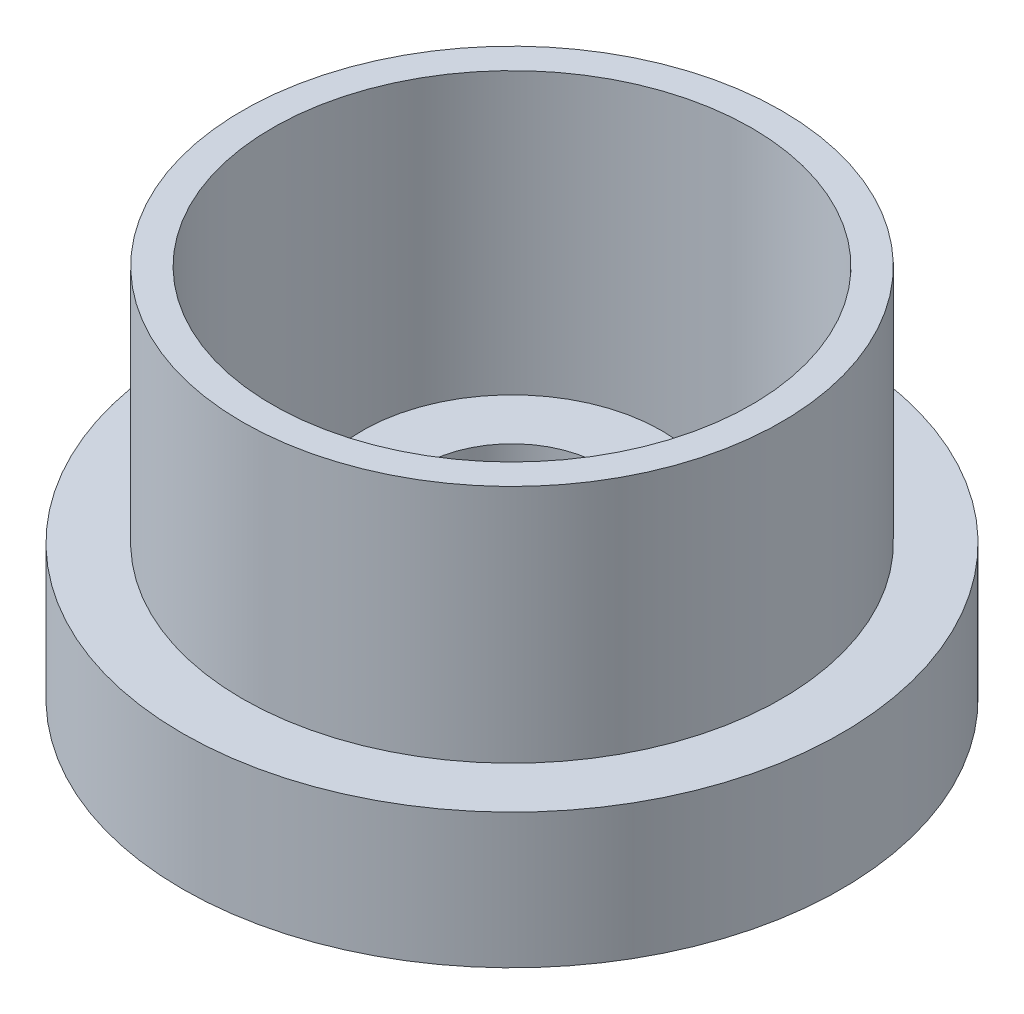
ISO-10303-21;
HEADER;
FILE_DESCRIPTION(('STEP AP214'),'2;1');
FILE_NAME('part.step','',(''),(''),'','','');
FILE_SCHEMA(('AUTOMOTIVE_DESIGN { 1 0 10303 214 1 1 1 1 }'));
ENDSEC;
DATA;
#1=APPLICATION_CONTEXT('core data for automotive mechanical design processes');
#2=APPLICATION_PROTOCOL_DEFINITION('international standard','automotive_design',2000,#1);
#3=PRODUCT_CONTEXT('',#1,'mechanical');
#4=PRODUCT('Part','Part','',(#3));
#5=PRODUCT_RELATED_PRODUCT_CATEGORY('part','',(#4));
#6=PRODUCT_DEFINITION_FORMATION('','',#4);
#7=PRODUCT_DEFINITION_CONTEXT('part definition',#1,'design');
#8=PRODUCT_DEFINITION('design','',#6,#7);
#9=PRODUCT_DEFINITION_SHAPE('','',#8);
#10=(LENGTH_UNIT() NAMED_UNIT(*) SI_UNIT(.MILLI.,.METRE.));
#11=(NAMED_UNIT(*) PLANE_ANGLE_UNIT() SI_UNIT($,.RADIAN.));
#12=(NAMED_UNIT(*) SI_UNIT($,.STERADIAN.) SOLID_ANGLE_UNIT());
#13=UNCERTAINTY_MEASURE_WITH_UNIT(LENGTH_MEASURE(1.E-05),#10,'distance_accuracy_value','');
#14=(GEOMETRIC_REPRESENTATION_CONTEXT(3) GLOBAL_UNCERTAINTY_ASSIGNED_CONTEXT((#13)) GLOBAL_UNIT_ASSIGNED_CONTEXT((#10,
#11,#12)) REPRESENTATION_CONTEXT('',''));
#15=CARTESIAN_POINT('',(0.,0.,0.));
#16=DIRECTION('',(0.,0.,1.));
#17=DIRECTION('',(1.,0.,0.));
#18=AXIS2_PLACEMENT_3D('',#15,#16,#17);
#19=CARTESIAN_POINT('',(-22.,0.,0.));
#20=DIRECTION('',(0.,1.,0.));
#21=DIRECTION('',(0.,0.,1.));
#22=AXIS2_PLACEMENT_3D('',#19,#20,#21);
#23=PLANE('',#22);
#24=CARTESIAN_POINT('',(0.,0.,0.));
#25=DIRECTION('',(0.,-1.,0.));
#26=DIRECTION('',(0.,0.,-1.));
#27=AXIS2_PLACEMENT_3D('',#24,#25,#26);
#28=CIRCLE('',#27,6.);
#29=CARTESIAN_POINT('',(0.,0.,-6.));
#30=VERTEX_POINT('',#29);
#31=EDGE_CURVE('E10',#30,#30,#28,.T.);
#32=ORIENTED_EDGE('',*,*,#31,.F.);
#33=EDGE_LOOP('',(#32));
#34=FACE_BOUND('',#33,.T.);
#35=CARTESIAN_POINT('',(0.,0.,0.));
#36=DIRECTION('',(0.,-1.,0.));
#37=DIRECTION('',(0.,0.,-1.));
#38=AXIS2_PLACEMENT_3D('',#35,#36,#37);
#39=CIRCLE('',#38,22.);
#40=CARTESIAN_POINT('',(0.,0.,-22.));
#41=VERTEX_POINT('',#40);
#42=EDGE_CURVE('E66',#41,#41,#39,.T.);
#43=ORIENTED_EDGE('',*,*,#42,.T.);
#44=EDGE_LOOP('',(#43));
#45=FACE_BOUND('',#44,.T.);
#46=ADVANCED_FACE('F32',(#34,#45),#23,.F.);
#47=CARTESIAN_POINT('',(0.,-75.1045135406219,0.));
#48=DIRECTION('',(0.,-1.,0.));
#49=DIRECTION('',(0.,0.,-1.));
#50=AXIS2_PLACEMENT_3D('',#47,#48,#49);
#51=CYLINDRICAL_SURFACE('',#50,6.);
#52=CARTESIAN_POINT('',(0.,10.5,0.));
#53=DIRECTION('',(0.,-1.,0.));
#54=DIRECTION('',(0.,0.,-1.));
#55=AXIS2_PLACEMENT_3D('',#52,#53,#54);
#56=CIRCLE('',#55,6.);
#57=CARTESIAN_POINT('',(0.,10.5,-6.));
#58=VERTEX_POINT('',#57);
#59=EDGE_CURVE('E38',#58,#58,#56,.T.);
#60=ORIENTED_EDGE('',*,*,#59,.F.);
#61=EDGE_LOOP('',(#60));
#62=FACE_BOUND('',#61,.T.);
#63=ORIENTED_EDGE('',*,*,#31,.T.);
#64=EDGE_LOOP('',(#63));
#65=FACE_BOUND('',#64,.T.);
#66=ADVANCED_FACE('F117',(#62,#65),#51,.F.);
#67=CARTESIAN_POINT('',(-6.,10.5,0.));
#68=DIRECTION('',(0.,-1.,0.));
#69=DIRECTION('',(0.,0.,-1.));
#70=AXIS2_PLACEMENT_3D('',#67,#68,#69);
#71=PLANE('',#70);
#72=CARTESIAN_POINT('',(0.,10.5,0.));
#73=DIRECTION('',(0.,-1.,0.));
#74=DIRECTION('',(0.,0.,-1.));
#75=AXIS2_PLACEMENT_3D('',#72,#73,#74);
#76=CIRCLE('',#75,10.);
#77=CARTESIAN_POINT('',(0.,10.5,-10.));
#78=VERTEX_POINT('',#77);
#79=EDGE_CURVE('E42',#78,#78,#76,.T.);
#80=ORIENTED_EDGE('',*,*,#79,.F.);
#81=EDGE_LOOP('',(#80));
#82=FACE_BOUND('',#81,.T.);
#83=ORIENTED_EDGE('',*,*,#59,.T.);
#84=EDGE_LOOP('',(#83));
#85=FACE_BOUND('',#84,.T.);
#86=ADVANCED_FACE('F112',(#82,#85),#71,.F.);
#87=CARTESIAN_POINT('',(0.,-75.1045135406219,0.));
#88=DIRECTION('',(0.,-1.,0.));
#89=DIRECTION('',(0.,0.,-1.));
#90=AXIS2_PLACEMENT_3D('',#87,#88,#89);
#91=CYLINDRICAL_SURFACE('',#90,10.);
#92=CARTESIAN_POINT('',(0.,5.,0.));
#93=DIRECTION('',(0.,-1.,0.));
#94=DIRECTION('',(0.,0.,-1.));
#95=AXIS2_PLACEMENT_3D('',#92,#93,#94);
#96=CIRCLE('',#95,10.);
#97=CARTESIAN_POINT('',(0.,5.,-10.));
#98=VERTEX_POINT('',#97);
#99=EDGE_CURVE('E46',#98,#98,#96,.T.);
#100=ORIENTED_EDGE('',*,*,#99,.F.);
#101=EDGE_LOOP('',(#100));
#102=FACE_BOUND('',#101,.T.);
#103=ORIENTED_EDGE('',*,*,#79,.T.);
#104=EDGE_LOOP('',(#103));
#105=FACE_BOUND('',#104,.T.);
#106=ADVANCED_FACE('F106',(#102,#105),#91,.T.);
#107=CARTESIAN_POINT('',(-10.,5.,0.));
#108=DIRECTION('',(0.,-1.,0.));
#109=DIRECTION('',(0.,0.,-1.));
#110=AXIS2_PLACEMENT_3D('',#107,#108,#109);
#111=PLANE('',#110);
#112=CARTESIAN_POINT('',(0.,5.,0.));
#113=DIRECTION('',(0.,-1.,0.));
#114=DIRECTION('',(0.,0.,-1.));
#115=AXIS2_PLACEMENT_3D('',#112,#113,#114);
#116=CIRCLE('',#115,16.);
#117=CARTESIAN_POINT('',(0.,5.,-16.));
#118=VERTEX_POINT('',#117);
#119=EDGE_CURVE('E51',#118,#118,#116,.T.);
#120=ORIENTED_EDGE('',*,*,#119,.F.);
#121=EDGE_LOOP('',(#120));
#122=FACE_BOUND('',#121,.T.);
#123=ORIENTED_EDGE('',*,*,#99,.T.);
#124=EDGE_LOOP('',(#123));
#125=FACE_BOUND('',#124,.T.);
#126=ADVANCED_FACE('F100',(#122,#125),#111,.F.);
#127=CARTESIAN_POINT('',(0.,-75.1045135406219,0.));
#128=DIRECTION('',(0.,-1.,0.));
#129=DIRECTION('',(0.,0.,-1.));
#130=AXIS2_PLACEMENT_3D('',#127,#128,#129);
#131=CYLINDRICAL_SURFACE('',#130,16.);
#132=CARTESIAN_POINT('',(0.,25.,0.));
#133=DIRECTION('',(0.,-1.,0.));
#134=DIRECTION('',(0.,0.,-1.));
#135=AXIS2_PLACEMENT_3D('',#132,#133,#134);
#136=CIRCLE('',#135,16.);
#137=CARTESIAN_POINT('',(0.,25.,-16.));
#138=VERTEX_POINT('',#137);
#139=EDGE_CURVE('E54',#138,#138,#136,.T.);
#140=ORIENTED_EDGE('',*,*,#139,.F.);
#141=EDGE_LOOP('',(#140));
#142=FACE_BOUND('',#141,.T.);
#143=ORIENTED_EDGE('',*,*,#119,.T.);
#144=EDGE_LOOP('',(#143));
#145=FACE_BOUND('',#144,.T.);
#146=ADVANCED_FACE('F94',(#142,#145),#131,.F.);
#147=CARTESIAN_POINT('',(-16.,25.,0.));
#148=DIRECTION('',(0.,-1.,0.));
#149=DIRECTION('',(0.,0.,-1.));
#150=AXIS2_PLACEMENT_3D('',#147,#148,#149);
#151=PLANE('',#150);
#152=CARTESIAN_POINT('',(0.,25.,0.));
#153=DIRECTION('',(0.,-1.,0.));
#154=DIRECTION('',(0.,0.,-1.));
#155=AXIS2_PLACEMENT_3D('',#152,#153,#154);
#156=CIRCLE('',#155,18.);
#157=CARTESIAN_POINT('',(0.,25.,-18.));
#158=VERTEX_POINT('',#157);
#159=EDGE_CURVE('E57',#158,#158,#156,.T.);
#160=ORIENTED_EDGE('',*,*,#159,.F.);
#161=EDGE_LOOP('',(#160));
#162=FACE_BOUND('',#161,.T.);
#163=ORIENTED_EDGE('',*,*,#139,.T.);
#164=EDGE_LOOP('',(#163));
#165=FACE_BOUND('',#164,.T.);
#166=ADVANCED_FACE('F88',(#162,#165),#151,.F.);
#167=CARTESIAN_POINT('',(0.,-75.1045135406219,0.));
#168=DIRECTION('',(0.,-1.,0.));
#169=DIRECTION('',(0.,0.,-1.));
#170=AXIS2_PLACEMENT_3D('',#167,#168,#169);
#171=CYLINDRICAL_SURFACE('',#170,18.);
#172=CARTESIAN_POINT('',(0.,8.99999999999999,0.));
#173=DIRECTION('',(0.,-1.,0.));
#174=DIRECTION('',(0.,0.,-1.));
#175=AXIS2_PLACEMENT_3D('',#172,#173,#174);
#176=CIRCLE('',#175,18.);
#177=CARTESIAN_POINT('',(0.,8.99999999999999,-18.));
#178=VERTEX_POINT('',#177);
#179=EDGE_CURVE('E60',#178,#178,#176,.T.);
#180=ORIENTED_EDGE('',*,*,#179,.F.);
#181=EDGE_LOOP('',(#180));
#182=FACE_BOUND('',#181,.T.);
#183=ORIENTED_EDGE('',*,*,#159,.T.);
#184=EDGE_LOOP('',(#183));
#185=FACE_BOUND('',#184,.T.);
#186=ADVANCED_FACE('F82',(#182,#185),#171,.T.);
#187=CARTESIAN_POINT('',(-18.,9.,0.));
#188=DIRECTION('',(0.,-1.,0.));
#189=DIRECTION('',(0.,0.,-1.));
#190=AXIS2_PLACEMENT_3D('',#187,#188,#189);
#191=PLANE('',#190);
#192=CARTESIAN_POINT('',(0.,8.99999999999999,0.));
#193=DIRECTION('',(0.,-1.,0.));
#194=DIRECTION('',(0.,0.,-1.));
#195=AXIS2_PLACEMENT_3D('',#192,#193,#194);
#196=CIRCLE('',#195,22.);
#197=CARTESIAN_POINT('',(0.,8.99999999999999,-22.));
#198=VERTEX_POINT('',#197);
#199=EDGE_CURVE('E63',#198,#198,#196,.T.);
#200=ORIENTED_EDGE('',*,*,#199,.F.);
#201=EDGE_LOOP('',(#200));
#202=FACE_BOUND('',#201,.T.);
#203=ORIENTED_EDGE('',*,*,#179,.T.);
#204=EDGE_LOOP('',(#203));
#205=FACE_BOUND('',#204,.T.);
#206=ADVANCED_FACE('F76',(#202,#205),#191,.F.);
#207=CARTESIAN_POINT('',(0.,-75.1045135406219,0.));
#208=DIRECTION('',(0.,-1.,0.));
#209=DIRECTION('',(0.,0.,-1.));
#210=AXIS2_PLACEMENT_3D('',#207,#208,#209);
#211=CYLINDRICAL_SURFACE('',#210,22.);
#212=ORIENTED_EDGE('',*,*,#42,.F.);
#213=EDGE_LOOP('',(#212));
#214=FACE_BOUND('',#213,.T.);
#215=ORIENTED_EDGE('',*,*,#199,.T.);
#216=EDGE_LOOP('',(#215));
#217=FACE_BOUND('',#216,.T.);
#218=ADVANCED_FACE('F73',(#214,#217),#211,.T.);
#219=CLOSED_SHELL('',(#46,#66,#86,#106,#126,#146,#166,#186,#206,#218));
#220=MANIFOLD_SOLID_BREP('B2',#219);
#221=ADVANCED_BREP_SHAPE_REPRESENTATION('',(#18,#220),#14);
#222=SHAPE_DEFINITION_REPRESENTATION(#9,#221);
ENDSEC;
END-ISO-10303-21;
